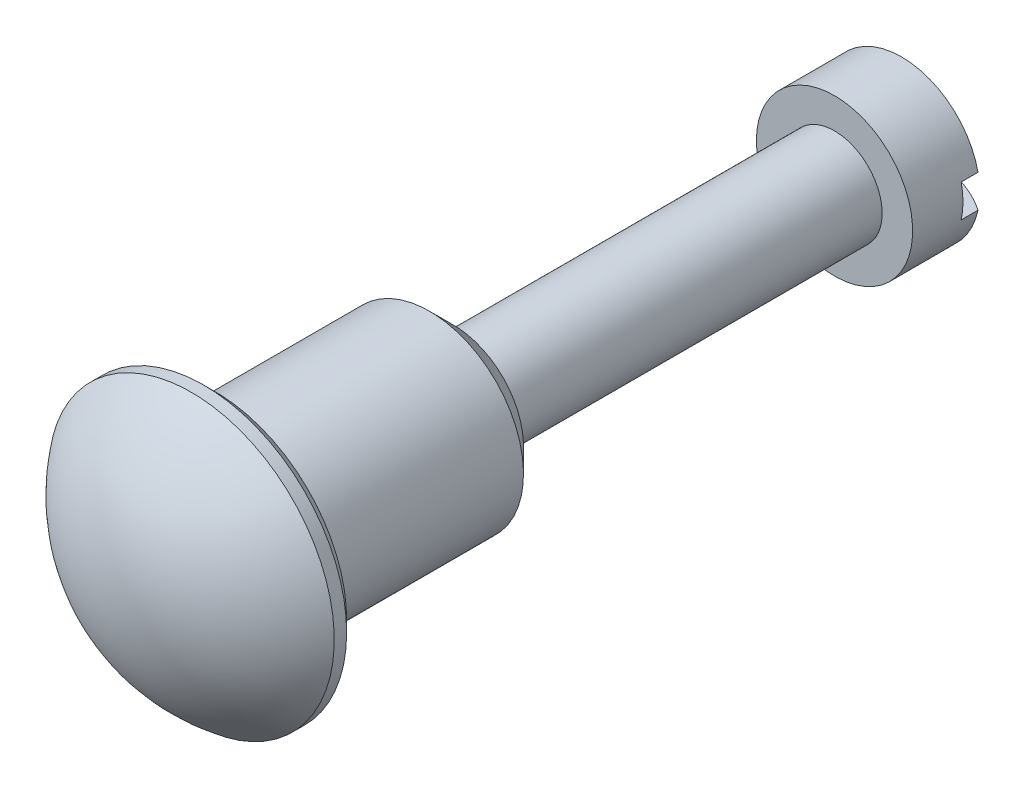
ISO-10303-21;
HEADER;
FILE_DESCRIPTION(('STEP AP214'),'2;1');
FILE_NAME('part.step','',(''),(''),'','','');
FILE_SCHEMA(('AUTOMOTIVE_DESIGN { 1 0 10303 214 1 1 1 1 }'));
ENDSEC;
DATA;
#1=APPLICATION_CONTEXT('core data for automotive mechanical design processes');
#2=APPLICATION_PROTOCOL_DEFINITION('international standard','automotive_design',2000,#1);
#3=PRODUCT_CONTEXT('',#1,'mechanical');
#4=PRODUCT('Part','Part','',(#3));
#5=PRODUCT_RELATED_PRODUCT_CATEGORY('part','',(#4));
#6=PRODUCT_DEFINITION_FORMATION('','',#4);
#7=PRODUCT_DEFINITION_CONTEXT('part definition',#1,'design');
#8=PRODUCT_DEFINITION('design','',#6,#7);
#9=PRODUCT_DEFINITION_SHAPE('','',#8);
#10=(LENGTH_UNIT() NAMED_UNIT(*) SI_UNIT(.MILLI.,.METRE.));
#11=(NAMED_UNIT(*) PLANE_ANGLE_UNIT() SI_UNIT($,.RADIAN.));
#12=(NAMED_UNIT(*) SI_UNIT($,.STERADIAN.) SOLID_ANGLE_UNIT());
#13=UNCERTAINTY_MEASURE_WITH_UNIT(LENGTH_MEASURE(1.E-05),#10,'distance_accuracy_value','');
#14=(GEOMETRIC_REPRESENTATION_CONTEXT(3) GLOBAL_UNCERTAINTY_ASSIGNED_CONTEXT((#13)) GLOBAL_UNIT_ASSIGNED_CONTEXT((#10,
#11,#12)) REPRESENTATION_CONTEXT('',''));
#15=CARTESIAN_POINT('',(0.,0.,0.));
#16=DIRECTION('',(0.,0.,1.));
#17=DIRECTION('',(1.,0.,0.));
#18=AXIS2_PLACEMENT_3D('',#15,#16,#17);
#19=CARTESIAN_POINT('',(0.,0.,-7.9375));
#20=DIRECTION('',(0.,0.,1.));
#21=DIRECTION('',(-0.941764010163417,-0.336274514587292,0.));
#22=AXIS2_PLACEMENT_3D('',#19,#20,#21);
#23=PLANE('',#22);
#24=CARTESIAN_POINT('',(0.,0.,-7.9375));
#25=DIRECTION('',(0.,0.,1.));
#26=DIRECTION('',(-0.941764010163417,-0.336274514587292,0.));
#27=AXIS2_PLACEMENT_3D('',#24,#25,#26);
#28=CIRCLE('',#27,2.3368);
#29=CARTESIAN_POINT('',(-2.20071413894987,-0.785806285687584,-7.9375));
#30=VERTEX_POINT('',#29);
#31=EDGE_CURVE('E65',#30,#30,#28,.F.);
#32=ORIENTED_EDGE('',*,*,#31,.T.);
#33=EDGE_LOOP('',(#32));
#34=FACE_BOUND('',#33,.T.);
#35=CARTESIAN_POINT('',(0.,0.,-7.9375));
#36=DIRECTION('',(0.,0.,-1.));
#37=DIRECTION('',(-1.,0.,0.));
#38=AXIS2_PLACEMENT_3D('',#35,#36,#37);
#39=CIRCLE('',#38,1.5875);
#40=CARTESIAN_POINT('',(-1.5875,0.,-7.9375));
#41=VERTEX_POINT('',#40);
#42=EDGE_CURVE('E9',#41,#41,#39,.F.);
#43=ORIENTED_EDGE('',*,*,#42,.T.);
#44=EDGE_LOOP('',(#43));
#45=FACE_BOUND('',#44,.T.);
#46=ADVANCED_FACE('F14',(#34,#45),#23,.F.);
#47=CARTESIAN_POINT('',(0.,0.,3.175));
#48=DIRECTION('',(0.,0.,1.));
#49=DIRECTION('',(-0.941764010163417,-0.336274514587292,0.));
#50=AXIS2_PLACEMENT_3D('',#47,#48,#49);
#51=CYLINDRICAL_SURFACE('',#50,3.13055);
#52=CARTESIAN_POINT('',(0.,0.,-7.14375));
#53=DIRECTION('',(0.,0.,1.));
#54=DIRECTION('',(-0.941764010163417,-0.336274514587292,0.));
#55=AXIS2_PLACEMENT_3D('',#52,#53,#54);
#56=CIRCLE('',#55,3.13055);
#57=CARTESIAN_POINT('',(-2.94823932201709,-1.05272418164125,-7.14375));
#58=VERTEX_POINT('',#57);
#59=EDGE_CURVE('E87',#58,#58,#56,.T.);
#60=ORIENTED_EDGE('',*,*,#59,.T.);
#61=EDGE_LOOP('',(#60));
#62=FACE_BOUND('',#61,.T.);
#63=CARTESIAN_POINT('',(0.,0.,0.));
#64=DIRECTION('',(0.,0.,1.));
#65=DIRECTION('',(-0.941764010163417,-0.336274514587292,0.));
#66=AXIS2_PLACEMENT_3D('',#63,#64,#65);
#67=CIRCLE('',#66,3.13055);
#68=CARTESIAN_POINT('',(-2.94823932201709,-1.05272418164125,0.));
#69=VERTEX_POINT('',#68);
#70=EDGE_CURVE('E84',#69,#69,#67,.T.);
#71=ORIENTED_EDGE('',*,*,#70,.F.);
#72=EDGE_LOOP('',(#71));
#73=FACE_BOUND('',#72,.T.);
#74=ADVANCED_FACE('F102',(#62,#73),#51,.T.);
#75=CARTESIAN_POINT('',(2.94823932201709,1.05272418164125,0.));
#76=DIRECTION('',(0.,0.,1.));
#77=DIRECTION('',(-0.941764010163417,-0.336274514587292,0.));
#78=AXIS2_PLACEMENT_3D('',#75,#76,#77);
#79=PLANE('',#78);
#80=CARTESIAN_POINT('',(0.,0.,0.));
#81=DIRECTION('',(0.,0.,1.));
#82=DIRECTION('',(-0.941764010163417,-0.336274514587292,0.));
#83=AXIS2_PLACEMENT_3D('',#80,#81,#82);
#84=CIRCLE('',#83,4.3815);
#85=CARTESIAN_POINT('',(-4.12633901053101,-1.47338678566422,0.));
#86=VERTEX_POINT('',#85);
#87=EDGE_CURVE('E81',#86,#86,#84,.T.);
#88=ORIENTED_EDGE('',*,*,#87,.F.);
#89=EDGE_LOOP('',(#88));
#90=FACE_BOUND('',#89,.T.);
#91=ORIENTED_EDGE('',*,*,#70,.T.);
#92=EDGE_LOOP('',(#91));
#93=FACE_BOUND('',#92,.T.);
#94=ADVANCED_FACE('F105',(#90,#93),#79,.F.);
#95=CARTESIAN_POINT('',(0.,0.,0.));
#96=DIRECTION('',(0.,0.,1.));
#97=DIRECTION('',(-0.941764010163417,-0.336274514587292,0.));
#98=AXIS2_PLACEMENT_3D('',#95,#96,#97);
#99=CONICAL_SURFACE('',#98,4.3815,0.785398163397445);
#100=CARTESIAN_POINT('',(0.,0.,0.381));
#101=DIRECTION('',(0.,0.,1.));
#102=DIRECTION('',(-0.941764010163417,-0.336274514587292,0.));
#103=AXIS2_PLACEMENT_3D('',#100,#101,#102);
#104=CIRCLE('',#103,4.7625);
#105=CARTESIAN_POINT('',(-4.48515109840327,-1.60150737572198,0.381));
#106=VERTEX_POINT('',#105);
#107=EDGE_CURVE('E78',#106,#106,#104,.T.);
#108=ORIENTED_EDGE('',*,*,#107,.F.);
#109=EDGE_LOOP('',(#108));
#110=FACE_BOUND('',#109,.T.);
#111=ORIENTED_EDGE('',*,*,#87,.T.);
#112=EDGE_LOOP('',(#111));
#113=FACE_BOUND('',#112,.T.);
#114=ADVANCED_FACE('F109',(#110,#113),#99,.T.);
#115=CARTESIAN_POINT('',(0.,0.,3.175));
#116=DIRECTION('',(0.,0.,1.));
#117=DIRECTION('',(-0.941764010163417,-0.336274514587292,0.));
#118=AXIS2_PLACEMENT_3D('',#115,#116,#117);
#119=CYLINDRICAL_SURFACE('',#118,4.7625);
#120=CARTESIAN_POINT('',(0.,0.,0.79375));
#121=DIRECTION('',(0.,0.,1.));
#122=DIRECTION('',(-0.941764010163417,-0.336274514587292,0.));
#123=AXIS2_PLACEMENT_3D('',#120,#121,#122);
#124=CIRCLE('',#123,4.7625);
#125=CARTESIAN_POINT('',(-4.48515109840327,-1.60150737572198,0.79375));
#126=VERTEX_POINT('',#125);
#127=EDGE_CURVE('E75',#126,#126,#124,.T.);
#128=ORIENTED_EDGE('',*,*,#127,.F.);
#129=EDGE_LOOP('',(#128));
#130=FACE_BOUND('',#129,.T.);
#131=ORIENTED_EDGE('',*,*,#107,.T.);
#132=EDGE_LOOP('',(#131));
#133=FACE_BOUND('',#132,.T.);
#134=ADVANCED_FACE('F116',(#130,#133),#119,.T.);
#135=CARTESIAN_POINT('',(0.,0.,-2.778125));
#136=DIRECTION('',(0.,0.,1.));
#137=DIRECTION('',(0.941764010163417,0.336274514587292,0.));
#138=AXIS2_PLACEMENT_3D('',#135,#136,#137);
#139=SPHERICAL_SURFACE('',#138,5.953125);
#140=ORIENTED_EDGE('',*,*,#127,.T.);
#141=EDGE_LOOP('',(#140));
#142=FACE_BOUND('',#141,.T.);
#143=ADVANCED_FACE('F98',(#142),#139,.T.);
#144=CARTESIAN_POINT('',(0.,0.,-7.14375));
#145=DIRECTION('',(0.,0.,1.));
#146=DIRECTION('',(-0.941764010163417,-0.336274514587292,0.));
#147=AXIS2_PLACEMENT_3D('',#144,#145,#146);
#148=CONICAL_SURFACE('',#147,3.13055,0.78539816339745);
#149=ORIENTED_EDGE('',*,*,#31,.F.);
#150=EDGE_LOOP('',(#149));
#151=FACE_BOUND('',#150,.T.);
#152=ORIENTED_EDGE('',*,*,#59,.F.);
#153=EDGE_LOOP('',(#152));
#154=FACE_BOUND('',#153,.T.);
#155=ADVANCED_FACE('F94',(#151,#154),#148,.T.);
#156=CARTESIAN_POINT('',(0.,0.,-19.10943203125));
#157=DIRECTION('',(0.,0.,-1.));
#158=DIRECTION('',(0.,1.,0.));
#159=AXIS2_PLACEMENT_3D('',#156,#157,#158);
#160=SPHERICAL_SURFACE('',#159,4.57606796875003);
#161=CARTESIAN_POINT('',(0.,0.,-22.8727));
#162=DIRECTION('',(0.,0.,-1.));
#163=DIRECTION('',(-1.,0.,0.));
#164=AXIS2_PLACEMENT_3D('',#161,#162,#163);
#165=CIRCLE('',#164,2.6035);
#166=CARTESIAN_POINT('',(2.54558186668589,-0.5461,-22.8727));
#167=VERTEX_POINT('',#166);
#168=CARTESIAN_POINT('',(-2.54558186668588,-0.5461,-22.8727));
#169=VERTEX_POINT('',#168);
#170=EDGE_CURVE('E70',#167,#169,#165,.T.);
#171=ORIENTED_EDGE('',*,*,#170,.T.);
#172=CARTESIAN_POINT('',(0.,-0.5461,-19.10943203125));
#173=DIRECTION('',(0.,1.,0.));
#174=DIRECTION('',(-1.,0.,0.));
#175=AXIS2_PLACEMENT_3D('',#172,#173,#174);
#176=CIRCLE('',#175,4.54336580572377);
#177=EDGE_CURVE('E253',#169,#167,#176,.F.);
#178=ORIENTED_EDGE('',*,*,#177,.T.);
#179=EDGE_LOOP('',(#171,#178));
#180=FACE_BOUND('',#179,.T.);
#181=ADVANCED_FACE('F97',(#180),#160,.T.);
#182=CARTESIAN_POINT('',(-2.54558186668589,0.5461,-22.8727));
#183=VERTEX_POINT('',#182);
#184=CARTESIAN_POINT('',(2.54558186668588,0.5461,-22.8727));
#185=VERTEX_POINT('',#184);
#186=EDGE_CURVE('E261',#183,#185,#165,.T.);
#187=ORIENTED_EDGE('',*,*,#186,.T.);
#188=CARTESIAN_POINT('',(0.,0.5461,-19.10943203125));
#189=DIRECTION('',(0.,-1.,0.));
#190=DIRECTION('',(1.,0.,0.));
#191=AXIS2_PLACEMENT_3D('',#188,#189,#190);
#192=CIRCLE('',#191,4.54336580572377);
#193=EDGE_CURVE('E257',#185,#183,#192,.F.);
#194=ORIENTED_EDGE('',*,*,#193,.T.);
#195=EDGE_LOOP('',(#187,#194));
#196=FACE_BOUND('',#195,.T.);
#197=ADVANCED_FACE('F177',(#196),#160,.T.);
#198=CARTESIAN_POINT('',(-2.6035,0.5461,-22.3139));
#199=DIRECTION('',(0.,-1.,0.));
#200=DIRECTION('',(1.,0.,0.));
#201=AXIS2_PLACEMENT_3D('',#198,#199,#200);
#202=PLANE('',#201);
#203=DIRECTION('',(0.,0.,-1.));
#204=VECTOR('',#203,1.);
#205=CARTESIAN_POINT('',(-2.54558186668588,0.5461,-49.0855));
#206=LINE('',#205,#204);
#207=CARTESIAN_POINT('',(-2.54558186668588,0.5461,-22.3139));
#208=VERTEX_POINT('',#207);
#209=EDGE_CURVE('E263',#208,#183,#206,.T.);
#210=ORIENTED_EDGE('',*,*,#209,.T.);
#211=ORIENTED_EDGE('',*,*,#193,.F.);
#212=DIRECTION('',(0.,0.,-1.));
#213=VECTOR('',#212,1.);
#214=CARTESIAN_POINT('',(2.54558186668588,0.5461,-49.0855));
#215=LINE('',#214,#213);
#216=CARTESIAN_POINT('',(2.54558186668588,0.5461,-22.3139));
#217=VERTEX_POINT('',#216);
#218=EDGE_CURVE('E58',#185,#217,#215,.F.);
#219=ORIENTED_EDGE('',*,*,#218,.T.);
#220=DIRECTION('',(-1.,0.,0.));
#221=VECTOR('',#220,1.);
#222=CARTESIAN_POINT('',(-2.6035,0.5461,-22.3139));
#223=LINE('',#222,#221);
#224=EDGE_CURVE('E54',#217,#208,#223,.T.);
#225=ORIENTED_EDGE('',*,*,#224,.T.);
#226=EDGE_LOOP('',(#210,#211,#219,#225));
#227=FACE_BOUND('',#226,.T.);
#228=ADVANCED_FACE('F187',(#227),#202,.T.);
#229=CARTESIAN_POINT('',(-2.6035,-0.5461,-22.3139));
#230=DIRECTION('',(0.,0.,-1.));
#231=DIRECTION('',(-1.,0.,0.));
#232=AXIS2_PLACEMENT_3D('',#229,#230,#231);
#233=PLANE('',#232);
#234=ORIENTED_EDGE('',*,*,#224,.F.);
#235=CARTESIAN_POINT('',(0.,0.,-22.3139));
#236=DIRECTION('',(0.,0.,-1.));
#237=DIRECTION('',(-1.,0.,0.));
#238=AXIS2_PLACEMENT_3D('',#235,#236,#237);
#239=CIRCLE('',#238,2.6035);
#240=CARTESIAN_POINT('',(2.54558186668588,-0.5461,-22.3139));
#241=VERTEX_POINT('',#240);
#242=EDGE_CURVE('E51',#217,#241,#239,.T.);
#243=ORIENTED_EDGE('',*,*,#242,.T.);
#244=DIRECTION('',(1.,0.,0.));
#245=VECTOR('',#244,1.);
#246=CARTESIAN_POINT('',(2.6035,-0.5461,-22.3139));
#247=LINE('',#246,#245);
#248=CARTESIAN_POINT('',(-2.54558186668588,-0.5461,-22.3139));
#249=VERTEX_POINT('',#248);
#250=EDGE_CURVE('E28',#249,#241,#247,.T.);
#251=ORIENTED_EDGE('',*,*,#250,.F.);
#252=EDGE_CURVE('E61',#249,#208,#239,.T.);
#253=ORIENTED_EDGE('',*,*,#252,.T.);
#254=EDGE_LOOP('',(#234,#243,#251,#253));
#255=FACE_BOUND('',#254,.T.);
#256=ADVANCED_FACE('F52',(#255),#233,.T.);
#257=CARTESIAN_POINT('',(2.6035,-0.5461,-22.3139));
#258=DIRECTION('',(0.,1.,0.));
#259=DIRECTION('',(-1.,0.,0.));
#260=AXIS2_PLACEMENT_3D('',#257,#258,#259);
#261=PLANE('',#260);
#262=DIRECTION('',(0.,0.,-1.));
#263=VECTOR('',#262,1.);
#264=CARTESIAN_POINT('',(2.54558186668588,-0.5461,-49.0855));
#265=LINE('',#264,#263);
#266=EDGE_CURVE('E21',#241,#167,#265,.T.);
#267=ORIENTED_EDGE('',*,*,#266,.T.);
#268=ORIENTED_EDGE('',*,*,#177,.F.);
#269=DIRECTION('',(0.,0.,-1.));
#270=VECTOR('',#269,1.);
#271=CARTESIAN_POINT('',(-2.54558186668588,-0.5461,-49.0855));
#272=LINE('',#271,#270);
#273=EDGE_CURVE('E59',#169,#249,#272,.F.);
#274=ORIENTED_EDGE('',*,*,#273,.T.);
#275=ORIENTED_EDGE('',*,*,#250,.T.);
#276=EDGE_LOOP('',(#267,#268,#274,#275));
#277=FACE_BOUND('',#276,.T.);
#278=ADVANCED_FACE('F62',(#277),#261,.T.);
#279=CARTESIAN_POINT('',(0.,0.,-49.0855));
#280=DIRECTION('',(0.,0.,-1.));
#281=DIRECTION('',(-1.,0.,0.));
#282=AXIS2_PLACEMENT_3D('',#279,#280,#281);
#283=CYLINDRICAL_SURFACE('',#282,2.6035);
#284=CARTESIAN_POINT('',(0.,0.,-20.6375));
#285=DIRECTION('',(0.,0.,-1.));
#286=DIRECTION('',(-1.,0.,0.));
#287=AXIS2_PLACEMENT_3D('',#284,#285,#286);
#288=CIRCLE('',#287,2.6035);
#289=CARTESIAN_POINT('',(-2.6035,0.,-20.6375));
#290=VERTEX_POINT('',#289);
#291=EDGE_CURVE('E252',#290,#290,#288,.T.);
#292=ORIENTED_EDGE('',*,*,#291,.T.);
#293=EDGE_LOOP('',(#292));
#294=FACE_BOUND('',#293,.T.);
#295=ORIENTED_EDGE('',*,*,#266,.F.);
#296=ORIENTED_EDGE('',*,*,#242,.F.);
#297=ORIENTED_EDGE('',*,*,#218,.F.);
#298=ORIENTED_EDGE('',*,*,#186,.F.);
#299=ORIENTED_EDGE('',*,*,#209,.F.);
#300=ORIENTED_EDGE('',*,*,#252,.F.);
#301=ORIENTED_EDGE('',*,*,#273,.F.);
#302=ORIENTED_EDGE('',*,*,#170,.F.);
#303=EDGE_LOOP('',(#295,#296,#297,#298,#299,#300,#301,#302));
#304=FACE_BOUND('',#303,.T.);
#305=ADVANCED_FACE('F68',(#294,#304),#283,.T.);
#306=CARTESIAN_POINT('',(0.,1.5875,-20.6375));
#307=DIRECTION('',(0.,0.,-1.));
#308=DIRECTION('',(-1.,0.,0.));
#309=AXIS2_PLACEMENT_3D('',#306,#307,#308);
#310=PLANE('',#309);
#311=ORIENTED_EDGE('',*,*,#291,.F.);
#312=EDGE_LOOP('',(#311));
#313=FACE_BOUND('',#312,.T.);
#314=CARTESIAN_POINT('',(0.,0.,-20.6375));
#315=DIRECTION('',(0.,0.,-1.));
#316=DIRECTION('',(-1.,0.,0.));
#317=AXIS2_PLACEMENT_3D('',#314,#315,#316);
#318=CIRCLE('',#317,1.5875);
#319=CARTESIAN_POINT('',(-1.5875,0.,-20.6375));
#320=VERTEX_POINT('',#319);
#321=EDGE_CURVE('E250',#320,#320,#318,.T.);
#322=ORIENTED_EDGE('',*,*,#321,.T.);
#323=EDGE_LOOP('',(#322));
#324=FACE_BOUND('',#323,.T.);
#325=ADVANCED_FACE('F221',(#313,#324),#310,.F.);
#326=CARTESIAN_POINT('',(0.,0.,-49.0855));
#327=DIRECTION('',(0.,0.,-1.));
#328=DIRECTION('',(-1.,0.,0.));
#329=AXIS2_PLACEMENT_3D('',#326,#327,#328);
#330=CYLINDRICAL_SURFACE('',#329,1.5875);
#331=ORIENTED_EDGE('',*,*,#42,.F.);
#332=EDGE_LOOP('',(#331));
#333=FACE_BOUND('',#332,.T.);
#334=ORIENTED_EDGE('',*,*,#321,.F.);
#335=EDGE_LOOP('',(#334));
#336=FACE_BOUND('',#335,.T.);
#337=ADVANCED_FACE('F231',(#333,#336),#330,.T.);
#338=CLOSED_SHELL('',(#46,#74,#94,#114,#134,#143,#155,#181,#197,#228,#256,#278,#305,#325,#337));
#339=MANIFOLD_SOLID_BREP('B1',#338);
#340=ADVANCED_BREP_SHAPE_REPRESENTATION('',(#18,#339),#14);
#341=SHAPE_DEFINITION_REPRESENTATION(#9,#340);
ENDSEC;
END-ISO-10303-21;
